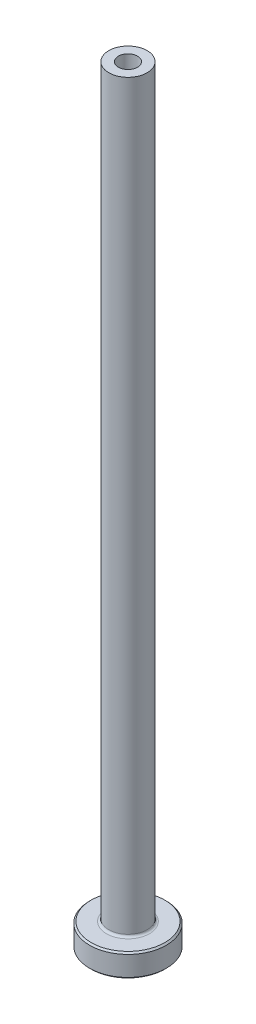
ISO-10303-21;
HEADER;
FILE_DESCRIPTION(('STEP AP214'),'2;1');
FILE_NAME('part.step','',(''),(''),'','','');
FILE_SCHEMA(('AUTOMOTIVE_DESIGN { 1 0 10303 214 1 1 1 1 }'));
ENDSEC;
DATA;
#1=APPLICATION_CONTEXT('core data for automotive mechanical design processes');
#2=APPLICATION_PROTOCOL_DEFINITION('international standard','automotive_design',2000,#1);
#3=PRODUCT_CONTEXT('',#1,'mechanical');
#4=PRODUCT('Part','Part','',(#3));
#5=PRODUCT_RELATED_PRODUCT_CATEGORY('part','',(#4));
#6=PRODUCT_DEFINITION_FORMATION('','',#4);
#7=PRODUCT_DEFINITION_CONTEXT('part definition',#1,'design');
#8=PRODUCT_DEFINITION('design','',#6,#7);
#9=PRODUCT_DEFINITION_SHAPE('','',#8);
#10=(LENGTH_UNIT() NAMED_UNIT(*) SI_UNIT(.MILLI.,.METRE.));
#11=(NAMED_UNIT(*) PLANE_ANGLE_UNIT() SI_UNIT($,.RADIAN.));
#12=(NAMED_UNIT(*) SI_UNIT($,.STERADIAN.) SOLID_ANGLE_UNIT());
#13=UNCERTAINTY_MEASURE_WITH_UNIT(LENGTH_MEASURE(1.E-05),#10,'distance_accuracy_value','');
#14=(GEOMETRIC_REPRESENTATION_CONTEXT(3) GLOBAL_UNCERTAINTY_ASSIGNED_CONTEXT((#13)) GLOBAL_UNIT_ASSIGNED_CONTEXT((#10,
#11,#12)) REPRESENTATION_CONTEXT('',''));
#15=CARTESIAN_POINT('',(0.,0.,0.));
#16=DIRECTION('',(0.,0.,1.));
#17=DIRECTION('',(1.,0.,0.));
#18=AXIS2_PLACEMENT_3D('',#15,#16,#17);
#19=CARTESIAN_POINT('',(0.,92.1876809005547,0.));
#20=DIRECTION('',(0.,1.,0.));
#21=DIRECTION('',(0.,0.,1.));
#22=AXIS2_PLACEMENT_3D('',#19,#20,#21);
#23=CYLINDRICAL_SURFACE('',#22,1.24999999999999);
#24=CARTESIAN_POINT('',(0.,100.,0.));
#25=DIRECTION('',(0.,1.,0.));
#26=DIRECTION('',(0.,0.,1.));
#27=AXIS2_PLACEMENT_3D('',#24,#25,#26);
#28=CIRCLE('',#27,1.24999999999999);
#29=CARTESIAN_POINT('',(0.,100.,1.24999999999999));
#30=VERTEX_POINT('',#29);
#31=EDGE_CURVE('E62',#30,#30,#28,.T.);
#32=ORIENTED_EDGE('',*,*,#31,.T.);
#33=EDGE_LOOP('',(#32));
#34=FACE_BOUND('',#33,.T.);
#35=CARTESIAN_POINT('',(0.,65.,0.));
#36=DIRECTION('',(0.,1.,0.));
#37=DIRECTION('',(0.,0.,1.));
#38=AXIS2_PLACEMENT_3D('',#35,#36,#37);
#39=CIRCLE('',#38,1.24999999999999);
#40=CARTESIAN_POINT('',(0.,65.,1.24999999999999));
#41=VERTEX_POINT('',#40);
#42=EDGE_CURVE('E71',#41,#41,#39,.T.);
#43=ORIENTED_EDGE('',*,*,#42,.F.);
#44=EDGE_LOOP('',(#43));
#45=FACE_BOUND('',#44,.T.);
#46=ADVANCED_FACE('F30',(#34,#45),#23,.F.);
#47=CARTESIAN_POINT('',(-1.24999999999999,100.,0.));
#48=DIRECTION('',(0.,1.,0.));
#49=DIRECTION('',(0.,0.,1.));
#50=AXIS2_PLACEMENT_3D('',#47,#48,#49);
#51=PLANE('',#50);
#52=CARTESIAN_POINT('',(0.,100.,0.));
#53=DIRECTION('',(0.,1.,0.));
#54=DIRECTION('',(0.,0.,1.));
#55=AXIS2_PLACEMENT_3D('',#52,#53,#54);
#56=CIRCLE('',#55,2.5);
#57=CARTESIAN_POINT('',(0.,100.,2.5));
#58=VERTEX_POINT('',#57);
#59=EDGE_CURVE('E65',#58,#58,#56,.T.);
#60=ORIENTED_EDGE('',*,*,#59,.T.);
#61=EDGE_LOOP('',(#60));
#62=FACE_BOUND('',#61,.T.);
#63=ORIENTED_EDGE('',*,*,#31,.F.);
#64=EDGE_LOOP('',(#63));
#65=FACE_BOUND('',#64,.T.);
#66=ADVANCED_FACE('F79',(#62,#65),#51,.T.);
#67=CARTESIAN_POINT('',(0.,92.1876809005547,0.));
#68=DIRECTION('',(0.,1.,0.));
#69=DIRECTION('',(0.,0.,1.));
#70=AXIS2_PLACEMENT_3D('',#67,#68,#69);
#71=CYLINDRICAL_SURFACE('',#70,2.5);
#72=CARTESIAN_POINT('',(0.,3.3,0.));
#73=DIRECTION('',(0.,1.,0.));
#74=DIRECTION('',(0.,0.,1.));
#75=AXIS2_PLACEMENT_3D('',#72,#73,#74);
#76=CIRCLE('',#75,2.5);
#77=CARTESIAN_POINT('',(0.,3.3,2.5));
#78=VERTEX_POINT('',#77);
#79=EDGE_CURVE('E59',#78,#78,#76,.T.);
#80=ORIENTED_EDGE('',*,*,#79,.T.);
#81=EDGE_LOOP('',(#80));
#82=FACE_BOUND('',#81,.T.);
#83=ORIENTED_EDGE('',*,*,#59,.F.);
#84=EDGE_LOOP('',(#83));
#85=FACE_BOUND('',#84,.T.);
#86=ADVANCED_FACE('F85',(#82,#85),#71,.T.);
#87=CARTESIAN_POINT('',(-2.49999999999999,3.,0.));
#88=DIRECTION('',(0.,1.,0.));
#89=DIRECTION('',(0.,0.,1.));
#90=AXIS2_PLACEMENT_3D('',#87,#88,#89);
#91=PLANE('',#90);
#92=CARTESIAN_POINT('',(0.,3.,0.));
#93=DIRECTION('',(0.,1.,0.));
#94=DIRECTION('',(0.,0.,1.));
#95=AXIS2_PLACEMENT_3D('',#92,#93,#94);
#96=CIRCLE('',#95,4.79999999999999);
#97=CARTESIAN_POINT('',(0.,3.,4.79999999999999));
#98=VERTEX_POINT('',#97);
#99=EDGE_CURVE('E53',#98,#98,#96,.T.);
#100=ORIENTED_EDGE('',*,*,#99,.T.);
#101=EDGE_LOOP('',(#100));
#102=FACE_BOUND('',#101,.T.);
#103=CARTESIAN_POINT('',(0.,3.,0.));
#104=DIRECTION('',(0.,1.,0.));
#105=DIRECTION('',(0.,0.,1.));
#106=AXIS2_PLACEMENT_3D('',#103,#104,#105);
#107=CIRCLE('',#106,2.8);
#108=CARTESIAN_POINT('',(0.,3.,2.8));
#109=VERTEX_POINT('',#108);
#110=EDGE_CURVE('E56',#109,#109,#107,.F.);
#111=ORIENTED_EDGE('',*,*,#110,.T.);
#112=EDGE_LOOP('',(#111));
#113=FACE_BOUND('',#112,.T.);
#114=ADVANCED_FACE('F111',(#102,#113),#91,.T.);
#115=CARTESIAN_POINT('',(0.,92.1876809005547,0.));
#116=DIRECTION('',(0.,1.,0.));
#117=DIRECTION('',(0.,0.,1.));
#118=AXIS2_PLACEMENT_3D('',#115,#116,#117);
#119=CYLINDRICAL_SURFACE('',#118,4.99999999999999);
#120=CARTESIAN_POINT('',(0.,2.80000000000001,0.));
#121=DIRECTION('',(0.,1.,0.));
#122=DIRECTION('',(0.,0.,1.));
#123=AXIS2_PLACEMENT_3D('',#120,#121,#122);
#124=CIRCLE('',#123,4.99999999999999);
#125=CARTESIAN_POINT('',(0.,2.80000000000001,4.99999999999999));
#126=VERTEX_POINT('',#125);
#127=EDGE_CURVE('E45',#126,#126,#124,.F.);
#128=ORIENTED_EDGE('',*,*,#127,.T.);
#129=EDGE_LOOP('',(#128));
#130=FACE_BOUND('',#129,.T.);
#131=CARTESIAN_POINT('',(0.,0.20000000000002,0.));
#132=DIRECTION('',(0.,-1.,0.));
#133=DIRECTION('',(0.,0.,-1.));
#134=AXIS2_PLACEMENT_3D('',#131,#132,#133);
#135=CIRCLE('',#134,4.99999999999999);
#136=CARTESIAN_POINT('',(0.,0.20000000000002,-4.99999999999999));
#137=VERTEX_POINT('',#136);
#138=EDGE_CURVE('E50',#137,#137,#135,.F.);
#139=ORIENTED_EDGE('',*,*,#138,.T.);
#140=EDGE_LOOP('',(#139));
#141=FACE_BOUND('',#140,.T.);
#142=ADVANCED_FACE('F108',(#130,#141),#119,.T.);
#143=CARTESIAN_POINT('',(-4.99999999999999,0.,0.));
#144=DIRECTION('',(0.,-1.,0.));
#145=DIRECTION('',(0.,0.,-1.));
#146=AXIS2_PLACEMENT_3D('',#143,#144,#145);
#147=PLANE('',#146);
#148=CARTESIAN_POINT('',(0.,0.,0.));
#149=DIRECTION('',(0.,-1.,0.));
#150=DIRECTION('',(0.,0.,-1.));
#151=AXIS2_PLACEMENT_3D('',#148,#149,#150);
#152=CIRCLE('',#151,1.99999999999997);
#153=CARTESIAN_POINT('',(0.,0.,-1.99999999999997));
#154=VERTEX_POINT('',#153);
#155=EDGE_CURVE('E37',#154,#154,#152,.F.);
#156=ORIENTED_EDGE('',*,*,#155,.T.);
#157=EDGE_LOOP('',(#156));
#158=FACE_BOUND('',#157,.T.);
#159=CARTESIAN_POINT('',(0.,0.,0.));
#160=DIRECTION('',(0.,-1.,0.));
#161=DIRECTION('',(0.,0.,-1.));
#162=AXIS2_PLACEMENT_3D('',#159,#160,#161);
#163=CIRCLE('',#162,4.79999999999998);
#164=CARTESIAN_POINT('',(0.,0.,-4.79999999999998));
#165=VERTEX_POINT('',#164);
#166=EDGE_CURVE('E41',#165,#165,#163,.T.);
#167=ORIENTED_EDGE('',*,*,#166,.T.);
#168=EDGE_LOOP('',(#167));
#169=FACE_BOUND('',#168,.T.);
#170=ADVANCED_FACE('F110',(#158,#169),#147,.T.);
#171=CARTESIAN_POINT('',(0.,92.1876809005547,0.));
#172=DIRECTION('',(0.,1.,0.));
#173=DIRECTION('',(0.,0.,1.));
#174=AXIS2_PLACEMENT_3D('',#171,#172,#173);
#175=CYLINDRICAL_SURFACE('',#174,1.49999999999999);
#176=CARTESIAN_POINT('',(0.,0.499999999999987,0.));
#177=DIRECTION('',(0.,-1.,0.));
#178=DIRECTION('',(0.,0.,-1.));
#179=AXIS2_PLACEMENT_3D('',#176,#177,#178);
#180=CIRCLE('',#179,1.49999999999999);
#181=CARTESIAN_POINT('',(0.,0.499999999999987,-1.49999999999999));
#182=VERTEX_POINT('',#181);
#183=EDGE_CURVE('E10',#182,#182,#180,.T.);
#184=ORIENTED_EDGE('',*,*,#183,.T.);
#185=EDGE_LOOP('',(#184));
#186=FACE_BOUND('',#185,.T.);
#187=CARTESIAN_POINT('',(0.,53.,0.));
#188=DIRECTION('',(0.,1.,0.));
#189=DIRECTION('',(0.,0.,1.));
#190=AXIS2_PLACEMENT_3D('',#187,#188,#189);
#191=CIRCLE('',#190,1.5);
#192=CARTESIAN_POINT('',(0.,53.,1.5));
#193=VERTEX_POINT('',#192);
#194=EDGE_CURVE('E68',#193,#193,#191,.T.);
#195=ORIENTED_EDGE('',*,*,#194,.T.);
#196=EDGE_LOOP('',(#195));
#197=FACE_BOUND('',#196,.T.);
#198=ADVANCED_FACE('F118',(#186,#197),#175,.F.);
#199=CARTESIAN_POINT('',(0.,53.,0.));
#200=DIRECTION('',(0.,-1.,0.));
#201=DIRECTION('',(0.,0.,-1.));
#202=AXIS2_PLACEMENT_3D('',#199,#200,#201);
#203=CONICAL_SURFACE('',#202,1.5,0.0208303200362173);
#204=ORIENTED_EDGE('',*,*,#42,.T.);
#205=EDGE_LOOP('',(#204));
#206=FACE_BOUND('',#205,.T.);
#207=ORIENTED_EDGE('',*,*,#194,.F.);
#208=EDGE_LOOP('',(#207));
#209=FACE_BOUND('',#208,.T.);
#210=ADVANCED_FACE('F75',(#206,#209),#203,.F.);
#211=CARTESIAN_POINT('',(0.,3.3,0.));
#212=DIRECTION('',(0.,1.,0.));
#213=DIRECTION('',(0.,0.,1.));
#214=AXIS2_PLACEMENT_3D('',#211,#212,#213);
#215=TOROIDAL_SURFACE('',#214,2.8,0.3);
#216=ORIENTED_EDGE('',*,*,#110,.F.);
#217=EDGE_LOOP('',(#216));
#218=FACE_BOUND('',#217,.T.);
#219=ORIENTED_EDGE('',*,*,#79,.F.);
#220=EDGE_LOOP('',(#219));
#221=FACE_BOUND('',#220,.T.);
#222=ADVANCED_FACE('F90',(#218,#221),#215,.F.);
#223=CARTESIAN_POINT('',(0.,3.,0.));
#224=DIRECTION('',(0.,-1.,0.));
#225=DIRECTION('',(0.,0.,-1.));
#226=AXIS2_PLACEMENT_3D('',#223,#224,#225);
#227=CONICAL_SURFACE('',#226,4.79999999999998,0.785398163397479);
#228=ORIENTED_EDGE('',*,*,#127,.F.);
#229=EDGE_LOOP('',(#228));
#230=FACE_BOUND('',#229,.T.);
#231=ORIENTED_EDGE('',*,*,#99,.F.);
#232=EDGE_LOOP('',(#231));
#233=FACE_BOUND('',#232,.T.);
#234=ADVANCED_FACE('F93',(#230,#233),#227,.T.);
#235=CARTESIAN_POINT('',(0.,0.20000000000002,0.));
#236=DIRECTION('',(0.,1.,0.));
#237=DIRECTION('',(0.,0.,1.));
#238=AXIS2_PLACEMENT_3D('',#235,#236,#237);
#239=CONICAL_SURFACE('',#238,4.99999999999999,0.785398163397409);
#240=ORIENTED_EDGE('',*,*,#166,.F.);
#241=EDGE_LOOP('',(#240));
#242=FACE_BOUND('',#241,.T.);
#243=ORIENTED_EDGE('',*,*,#138,.F.);
#244=EDGE_LOOP('',(#243));
#245=FACE_BOUND('',#244,.T.);
#246=ADVANCED_FACE('F96',(#242,#245),#239,.T.);
#247=CARTESIAN_POINT('',(0.,0.,0.));
#248=DIRECTION('',(0.,-1.,0.));
#249=DIRECTION('',(0.,0.,-1.));
#250=AXIS2_PLACEMENT_3D('',#247,#248,#249);
#251=CONICAL_SURFACE('',#250,1.99999999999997,0.785398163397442);
#252=ORIENTED_EDGE('',*,*,#183,.F.);
#253=EDGE_LOOP('',(#252));
#254=FACE_BOUND('',#253,.T.);
#255=ORIENTED_EDGE('',*,*,#155,.F.);
#256=EDGE_LOOP('',(#255));
#257=FACE_BOUND('',#256,.T.);
#258=ADVANCED_FACE('F32',(#254,#257),#251,.F.);
#259=CLOSED_SHELL('',(#46,#66,#86,#114,#142,#170,#198,#210,#222,#234,#246,#258));
#260=MANIFOLD_SOLID_BREP('B2',#259);
#261=ADVANCED_BREP_SHAPE_REPRESENTATION('',(#18,#260),#14);
#262=SHAPE_DEFINITION_REPRESENTATION(#9,#261);
ENDSEC;
END-ISO-10303-21;
